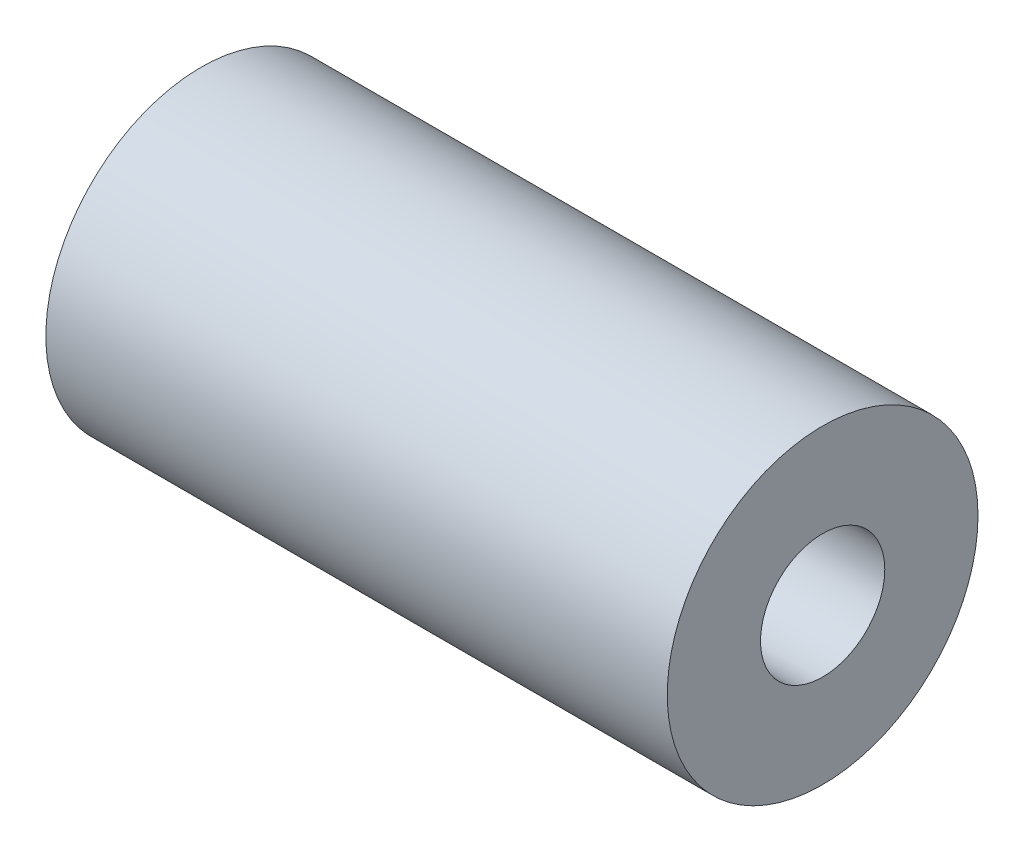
from build123d import *

# Parameters (mm, degrees)
SKETCH1_R           = 12.5
SKETCH1_R_2         = 5
BOSS_EXTRUDE1_DEPTH = 50


with BuildPart() as part:
    # Sketch1 → Boss-Extrude1 (new body)
    with BuildSketch(Plane(origin=(0, 0, 0), x_dir=(0, 0, -1), z_dir=(1, 0, 0))):
        Circle(SKETCH1_R)
        Circle(SKETCH1_R_2, mode=Mode.SUBTRACT)
    extrude(amount=BOSS_EXTRUDE1_DEPTH)


solid = part.part
